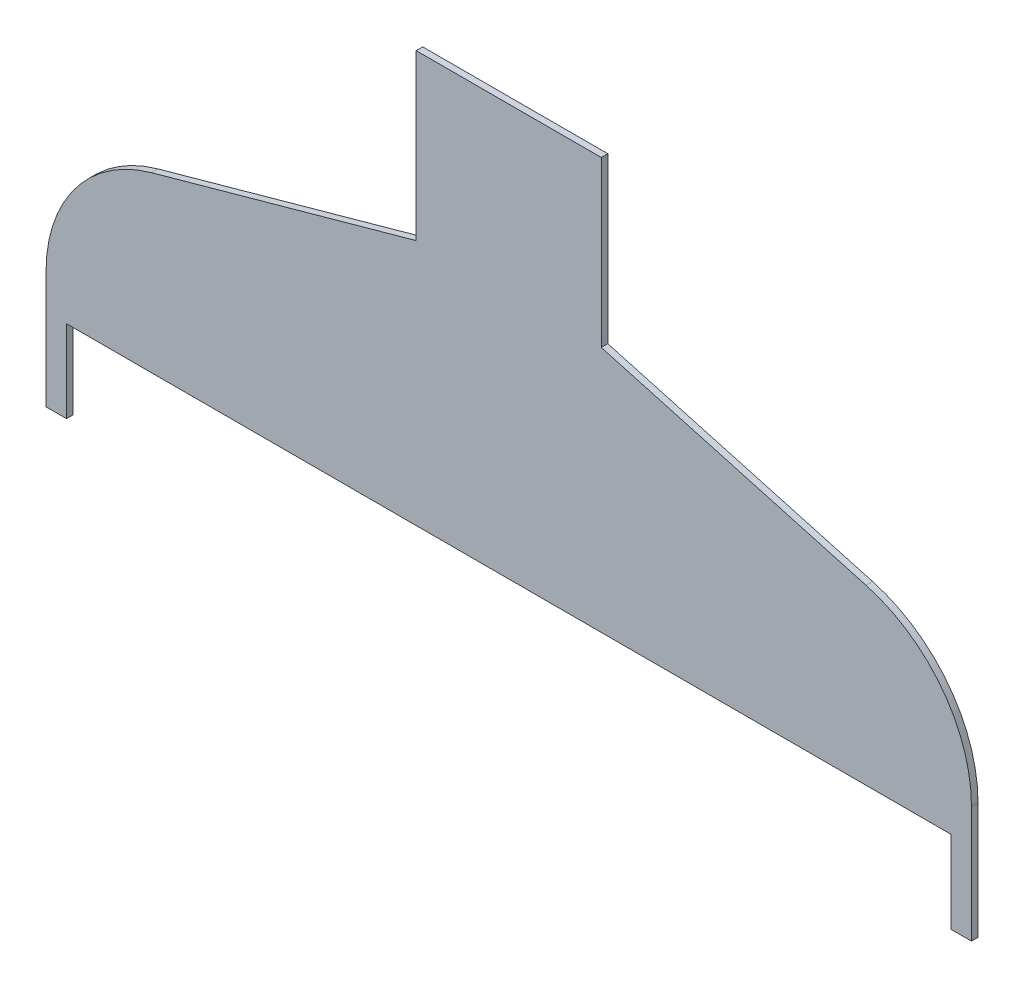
ISO-10303-21;
HEADER;
FILE_DESCRIPTION(('STEP AP214'),'2;1');
FILE_NAME('part.step','',(''),(''),'','','');
FILE_SCHEMA(('AUTOMOTIVE_DESIGN { 1 0 10303 214 1 1 1 1 }'));
ENDSEC;
DATA;
#1=APPLICATION_CONTEXT('core data for automotive mechanical design processes');
#2=APPLICATION_PROTOCOL_DEFINITION('international standard','automotive_design',2000,#1);
#3=PRODUCT_CONTEXT('',#1,'mechanical');
#4=PRODUCT('Part','Part','',(#3));
#5=PRODUCT_RELATED_PRODUCT_CATEGORY('part','',(#4));
#6=PRODUCT_DEFINITION_FORMATION('','',#4);
#7=PRODUCT_DEFINITION_CONTEXT('part definition',#1,'design');
#8=PRODUCT_DEFINITION('design','',#6,#7);
#9=PRODUCT_DEFINITION_SHAPE('','',#8);
#10=(LENGTH_UNIT() NAMED_UNIT(*) SI_UNIT(.MILLI.,.METRE.));
#11=(NAMED_UNIT(*) PLANE_ANGLE_UNIT() SI_UNIT($,.RADIAN.));
#12=(NAMED_UNIT(*) SI_UNIT($,.STERADIAN.) SOLID_ANGLE_UNIT());
#13=UNCERTAINTY_MEASURE_WITH_UNIT(LENGTH_MEASURE(1.E-05),#10,'distance_accuracy_value','');
#14=(GEOMETRIC_REPRESENTATION_CONTEXT(3) GLOBAL_UNCERTAINTY_ASSIGNED_CONTEXT((#13)) GLOBAL_UNIT_ASSIGNED_CONTEXT((#10,
#11,#12)) REPRESENTATION_CONTEXT('',''));
#15=CARTESIAN_POINT('',(0.,0.,0.));
#16=DIRECTION('',(0.,0.,1.));
#17=DIRECTION('',(1.,0.,0.));
#18=AXIS2_PLACEMENT_3D('',#15,#16,#17);
#19=CARTESIAN_POINT('',(-180.,-33.205995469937,3.175));
#20=DIRECTION('',(1.,0.,0.));
#21=DIRECTION('',(0.,0.,-1.));
#22=AXIS2_PLACEMENT_3D('',#19,#20,#21);
#23=PLANE('',#22);
#24=DIRECTION('',(0.,-1.,0.));
#25=VECTOR('',#24,1.);
#26=CARTESIAN_POINT('',(-180.,-33.205995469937,0.));
#27=LINE('',#26,#25);
#28=CARTESIAN_POINT('',(-180.,-33.205995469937,0.));
#29=VERTEX_POINT('',#28);
#30=CARTESIAN_POINT('',(-180.,-90.,0.));
#31=VERTEX_POINT('',#30);
#32=EDGE_CURVE('E165',#29,#31,#27,.T.);
#33=ORIENTED_EDGE('',*,*,#32,.T.);
#34=DIRECTION('',(0.,0.,-1.));
#35=VECTOR('',#34,1.);
#36=CARTESIAN_POINT('',(-180.,-90.,3.175));
#37=LINE('',#36,#35);
#38=CARTESIAN_POINT('',(-180.,-90.,3.175));
#39=VERTEX_POINT('',#38);
#40=EDGE_CURVE('E11',#39,#31,#37,.T.);
#41=ORIENTED_EDGE('',*,*,#40,.F.);
#42=DIRECTION('',(0.,-1.,0.));
#43=VECTOR('',#42,1.);
#44=CARTESIAN_POINT('',(-180.,-33.205995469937,3.175));
#45=LINE('',#44,#43);
#46=CARTESIAN_POINT('',(-180.,-33.205995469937,3.175));
#47=VERTEX_POINT('',#46);
#48=EDGE_CURVE('E192',#47,#39,#45,.T.);
#49=ORIENTED_EDGE('',*,*,#48,.F.);
#50=DIRECTION('',(0.,0.,-1.));
#51=VECTOR('',#50,1.);
#52=CARTESIAN_POINT('',(-180.,-33.205995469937,3.175));
#53=LINE('',#52,#51);
#54=EDGE_CURVE('E161',#47,#29,#53,.T.);
#55=ORIENTED_EDGE('',*,*,#54,.T.);
#56=EDGE_LOOP('',(#33,#41,#49,#55));
#57=FACE_BOUND('',#56,.T.);
#58=ADVANCED_FACE('F33',(#57),#23,.F.);
#59=CARTESIAN_POINT('',(-170.,-90.,3.175));
#60=DIRECTION('',(0.,1.,0.));
#61=DIRECTION('',(0.,0.,1.));
#62=AXIS2_PLACEMENT_3D('',#59,#60,#61);
#63=PLANE('',#62);
#64=DIRECTION('',(1.,0.,0.));
#65=VECTOR('',#64,1.);
#66=CARTESIAN_POINT('',(-170.,-90.,0.));
#67=LINE('',#66,#65);
#68=CARTESIAN_POINT('',(-170.,-90.,0.));
#69=VERTEX_POINT('',#68);
#70=EDGE_CURVE('E168',#31,#69,#67,.T.);
#71=ORIENTED_EDGE('',*,*,#70,.T.);
#72=DIRECTION('',(0.,0.,-1.));
#73=VECTOR('',#72,1.);
#74=CARTESIAN_POINT('',(-170.,-90.,3.175));
#75=LINE('',#74,#73);
#76=CARTESIAN_POINT('',(-170.,-90.,3.175));
#77=VERTEX_POINT('',#76);
#78=EDGE_CURVE('E41',#77,#69,#75,.T.);
#79=ORIENTED_EDGE('',*,*,#78,.F.);
#80=DIRECTION('',(1.,0.,0.));
#81=VECTOR('',#80,1.);
#82=CARTESIAN_POINT('',(-170.,-90.,3.175));
#83=LINE('',#82,#81);
#84=EDGE_CURVE('E110',#39,#77,#83,.T.);
#85=ORIENTED_EDGE('',*,*,#84,.F.);
#86=ORIENTED_EDGE('',*,*,#40,.T.);
#87=EDGE_LOOP('',(#71,#79,#85,#86));
#88=FACE_BOUND('',#87,.T.);
#89=ADVANCED_FACE('F279',(#88),#63,.F.);
#90=CARTESIAN_POINT('',(-170.,-90.,3.175));
#91=DIRECTION('',(-1.,0.,0.));
#92=DIRECTION('',(0.,-1.,0.));
#93=AXIS2_PLACEMENT_3D('',#90,#91,#92);
#94=PLANE('',#93);
#95=DIRECTION('',(0.,1.,0.));
#96=VECTOR('',#95,1.);
#97=CARTESIAN_POINT('',(-170.,-90.,0.));
#98=LINE('',#97,#96);
#99=CARTESIAN_POINT('',(-170.,-50.,0.));
#100=VERTEX_POINT('',#99);
#101=EDGE_CURVE('E170',#69,#100,#98,.T.);
#102=ORIENTED_EDGE('',*,*,#101,.T.);
#103=DIRECTION('',(0.,0.,-1.));
#104=VECTOR('',#103,1.);
#105=CARTESIAN_POINT('',(-170.,-50.,3.175));
#106=LINE('',#105,#104);
#107=CARTESIAN_POINT('',(-170.,-50.,3.175));
#108=VERTEX_POINT('',#107);
#109=EDGE_CURVE('E217',#108,#100,#106,.T.);
#110=ORIENTED_EDGE('',*,*,#109,.F.);
#111=DIRECTION('',(0.,1.,0.));
#112=VECTOR('',#111,1.);
#113=CARTESIAN_POINT('',(-170.,-90.,3.175));
#114=LINE('',#113,#112);
#115=EDGE_CURVE('E225',#77,#108,#114,.T.);
#116=ORIENTED_EDGE('',*,*,#115,.F.);
#117=ORIENTED_EDGE('',*,*,#78,.T.);
#118=EDGE_LOOP('',(#102,#110,#116,#117));
#119=FACE_BOUND('',#118,.T.);
#120=ADVANCED_FACE('F223',(#119),#94,.F.);
#121=CARTESIAN_POINT('',(260.,-50.,3.175));
#122=DIRECTION('',(0.,1.,0.));
#123=DIRECTION('',(0.,0.,1.));
#124=AXIS2_PLACEMENT_3D('',#121,#122,#123);
#125=PLANE('',#124);
#126=DIRECTION('',(1.,0.,0.));
#127=VECTOR('',#126,1.);
#128=CARTESIAN_POINT('',(260.,-50.,0.));
#129=LINE('',#128,#127);
#130=CARTESIAN_POINT('',(260.,-50.,0.));
#131=VERTEX_POINT('',#130);
#132=EDGE_CURVE('E173',#100,#131,#129,.T.);
#133=ORIENTED_EDGE('',*,*,#132,.T.);
#134=DIRECTION('',(0.,0.,-1.));
#135=VECTOR('',#134,1.);
#136=CARTESIAN_POINT('',(260.,-50.,3.175));
#137=LINE('',#136,#135);
#138=CARTESIAN_POINT('',(260.,-50.,3.175));
#139=VERTEX_POINT('',#138);
#140=EDGE_CURVE('E214',#139,#131,#137,.T.);
#141=ORIENTED_EDGE('',*,*,#140,.F.);
#142=DIRECTION('',(1.,0.,0.));
#143=VECTOR('',#142,1.);
#144=CARTESIAN_POINT('',(-170.,-50.,3.175));
#145=LINE('',#144,#143);
#146=EDGE_CURVE('E242',#108,#139,#145,.T.);
#147=ORIENTED_EDGE('',*,*,#146,.F.);
#148=ORIENTED_EDGE('',*,*,#109,.T.);
#149=EDGE_LOOP('',(#133,#141,#147,#148));
#150=FACE_BOUND('',#149,.T.);
#151=ADVANCED_FACE('F233',(#150),#125,.F.);
#152=CARTESIAN_POINT('',(260.,-90.,3.175));
#153=DIRECTION('',(1.,0.,0.));
#154=DIRECTION('',(0.,0.,-1.));
#155=AXIS2_PLACEMENT_3D('',#152,#153,#154);
#156=PLANE('',#155);
#157=DIRECTION('',(0.,-1.,0.));
#158=VECTOR('',#157,1.);
#159=CARTESIAN_POINT('',(260.,-90.,0.));
#160=LINE('',#159,#158);
#161=CARTESIAN_POINT('',(260.,-90.,0.));
#162=VERTEX_POINT('',#161);
#163=EDGE_CURVE('E175',#131,#162,#160,.T.);
#164=ORIENTED_EDGE('',*,*,#163,.T.);
#165=DIRECTION('',(0.,0.,-1.));
#166=VECTOR('',#165,1.);
#167=CARTESIAN_POINT('',(260.,-90.,3.175));
#168=LINE('',#167,#166);
#169=CARTESIAN_POINT('',(260.,-90.,3.175));
#170=VERTEX_POINT('',#169);
#171=EDGE_CURVE('E211',#170,#162,#168,.T.);
#172=ORIENTED_EDGE('',*,*,#171,.F.);
#173=DIRECTION('',(0.,-1.,0.));
#174=VECTOR('',#173,1.);
#175=CARTESIAN_POINT('',(260.,-90.,3.175));
#176=LINE('',#175,#174);
#177=EDGE_CURVE('E239',#139,#170,#176,.T.);
#178=ORIENTED_EDGE('',*,*,#177,.F.);
#179=ORIENTED_EDGE('',*,*,#140,.T.);
#180=EDGE_LOOP('',(#164,#172,#178,#179));
#181=FACE_BOUND('',#180,.T.);
#182=ADVANCED_FACE('F237',(#181),#156,.F.);
#183=CARTESIAN_POINT('',(260.,-90.,3.175));
#184=DIRECTION('',(0.,1.,0.));
#185=DIRECTION('',(0.,0.,1.));
#186=AXIS2_PLACEMENT_3D('',#183,#184,#185);
#187=PLANE('',#186);
#188=DIRECTION('',(1.,0.,0.));
#189=VECTOR('',#188,1.);
#190=CARTESIAN_POINT('',(260.,-90.,0.));
#191=LINE('',#190,#189);
#192=CARTESIAN_POINT('',(270.,-90.,0.));
#193=VERTEX_POINT('',#192);
#194=EDGE_CURVE('E177',#162,#193,#191,.T.);
#195=ORIENTED_EDGE('',*,*,#194,.T.);
#196=DIRECTION('',(0.,0.,-1.));
#197=VECTOR('',#196,1.);
#198=CARTESIAN_POINT('',(270.,-90.,3.175));
#199=LINE('',#198,#197);
#200=CARTESIAN_POINT('',(270.,-90.,3.175));
#201=VERTEX_POINT('',#200);
#202=EDGE_CURVE('E208',#201,#193,#199,.T.);
#203=ORIENTED_EDGE('',*,*,#202,.F.);
#204=DIRECTION('',(1.,0.,0.));
#205=VECTOR('',#204,1.);
#206=CARTESIAN_POINT('',(260.,-90.,3.175));
#207=LINE('',#206,#205);
#208=EDGE_CURVE('E241',#170,#201,#207,.T.);
#209=ORIENTED_EDGE('',*,*,#208,.F.);
#210=ORIENTED_EDGE('',*,*,#171,.T.);
#211=EDGE_LOOP('',(#195,#203,#209,#210));
#212=FACE_BOUND('',#211,.T.);
#213=ADVANCED_FACE('F292',(#212),#187,.F.);
#214=CARTESIAN_POINT('',(270.,-33.205995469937,3.175));
#215=DIRECTION('',(-1.,0.,0.));
#216=DIRECTION('',(0.,0.,1.));
#217=AXIS2_PLACEMENT_3D('',#214,#215,#216);
#218=PLANE('',#217);
#219=DIRECTION('',(0.,1.,0.));
#220=VECTOR('',#219,1.);
#221=CARTESIAN_POINT('',(270.,-33.205995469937,0.));
#222=LINE('',#221,#220);
#223=CARTESIAN_POINT('',(270.,-33.205995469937,0.));
#224=VERTEX_POINT('',#223);
#225=EDGE_CURVE('E179',#193,#224,#222,.T.);
#226=ORIENTED_EDGE('',*,*,#225,.T.);
#227=DIRECTION('',(0.,0.,-1.));
#228=VECTOR('',#227,1.);
#229=CARTESIAN_POINT('',(270.,-33.205995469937,3.175));
#230=LINE('',#229,#228);
#231=CARTESIAN_POINT('',(270.,-33.205995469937,3.175));
#232=VERTEX_POINT('',#231);
#233=EDGE_CURVE('E205',#232,#224,#230,.T.);
#234=ORIENTED_EDGE('',*,*,#233,.F.);
#235=DIRECTION('',(0.,1.,0.));
#236=VECTOR('',#235,1.);
#237=CARTESIAN_POINT('',(270.,-33.205995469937,3.175));
#238=LINE('',#237,#236);
#239=EDGE_CURVE('E244',#201,#232,#238,.T.);
#240=ORIENTED_EDGE('',*,*,#239,.F.);
#241=ORIENTED_EDGE('',*,*,#202,.T.);
#242=EDGE_LOOP('',(#226,#234,#240,#241));
#243=FACE_BOUND('',#242,.T.);
#244=ADVANCED_FACE('F295',(#243),#218,.F.);
#245=CARTESIAN_POINT('',(200.,-33.2059954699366,3.175));
#246=DIRECTION('',(0.,0.,-1.));
#247=DIRECTION('',(-1.,0.,0.));
#248=AXIS2_PLACEMENT_3D('',#245,#246,#247);
#249=CYLINDRICAL_SURFACE('',#248,70.);
#250=CARTESIAN_POINT('',(200.,-33.2059954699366,0.));
#251=DIRECTION('',(0.,0.,1.));
#252=DIRECTION('',(-1.,0.,0.));
#253=AXIS2_PLACEMENT_3D('',#250,#251,#252);
#254=CIRCLE('',#253,70.);
#255=CARTESIAN_POINT('',(218.735070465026,34.2402582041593,0.));
#256=VERTEX_POINT('',#255);
#257=EDGE_CURVE('E181',#224,#256,#254,.T.);
#258=ORIENTED_EDGE('',*,*,#257,.T.);
#259=DIRECTION('',(0.,0.,-1.));
#260=VECTOR('',#259,1.);
#261=CARTESIAN_POINT('',(218.735070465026,34.2402582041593,3.175));
#262=LINE('',#261,#260);
#263=CARTESIAN_POINT('',(218.735070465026,34.2402582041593,3.175));
#264=VERTEX_POINT('',#263);
#265=EDGE_CURVE('E202',#264,#256,#262,.T.);
#266=ORIENTED_EDGE('',*,*,#265,.F.);
#267=CARTESIAN_POINT('',(200.,-33.2059954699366,3.175));
#268=DIRECTION('',(0.,0.,1.));
#269=DIRECTION('',(-1.,0.,0.));
#270=AXIS2_PLACEMENT_3D('',#267,#268,#269);
#271=CIRCLE('',#270,70.);
#272=EDGE_CURVE('E250',#232,#264,#271,.T.);
#273=ORIENTED_EDGE('',*,*,#272,.F.);
#274=ORIENTED_EDGE('',*,*,#233,.T.);
#275=EDGE_LOOP('',(#258,#266,#273,#274));
#276=FACE_BOUND('',#275,.T.);
#277=ADVANCED_FACE('F299',(#276),#249,.T.);
#278=CARTESIAN_POINT('',(89.9999999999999,70.,3.175));
#279=DIRECTION('',(-0.267643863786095,-0.963517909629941,0.));
#280=DIRECTION('',(0.963517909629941,-0.267643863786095,0.));
#281=AXIS2_PLACEMENT_3D('',#278,#279,#280);
#282=PLANE('',#281);
#283=DIRECTION('',(-0.963517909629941,0.267643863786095,0.));
#284=VECTOR('',#283,1.);
#285=CARTESIAN_POINT('',(89.9999999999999,70.,0.));
#286=LINE('',#285,#284);
#287=CARTESIAN_POINT('',(89.9999999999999,70.,0.));
#288=VERTEX_POINT('',#287);
#289=EDGE_CURVE('E183',#256,#288,#286,.T.);
#290=ORIENTED_EDGE('',*,*,#289,.T.);
#291=DIRECTION('',(0.,0.,-1.));
#292=VECTOR('',#291,1.);
#293=CARTESIAN_POINT('',(89.9999999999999,70.,3.175));
#294=LINE('',#293,#292);
#295=CARTESIAN_POINT('',(89.9999999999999,70.,3.175));
#296=VERTEX_POINT('',#295);
#297=EDGE_CURVE('E199',#296,#288,#294,.T.);
#298=ORIENTED_EDGE('',*,*,#297,.F.);
#299=DIRECTION('',(-0.963517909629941,0.267643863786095,0.));
#300=VECTOR('',#299,1.);
#301=CARTESIAN_POINT('',(89.9999999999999,70.,3.175));
#302=LINE('',#301,#300);
#303=EDGE_CURVE('E252',#264,#296,#302,.T.);
#304=ORIENTED_EDGE('',*,*,#303,.F.);
#305=ORIENTED_EDGE('',*,*,#265,.T.);
#306=EDGE_LOOP('',(#290,#298,#304,#305));
#307=FACE_BOUND('',#306,.T.);
#308=ADVANCED_FACE('F303',(#307),#282,.F.);
#309=CARTESIAN_POINT('',(89.9999999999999,150.,3.175));
#310=DIRECTION('',(-1.,0.,0.));
#311=DIRECTION('',(0.,0.,1.));
#312=AXIS2_PLACEMENT_3D('',#309,#310,#311);
#313=PLANE('',#312);
#314=DIRECTION('',(0.,1.,0.));
#315=VECTOR('',#314,1.);
#316=CARTESIAN_POINT('',(89.9999999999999,150.,0.));
#317=LINE('',#316,#315);
#318=CARTESIAN_POINT('',(89.9999999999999,150.,0.));
#319=VERTEX_POINT('',#318);
#320=EDGE_CURVE('E185',#288,#319,#317,.T.);
#321=ORIENTED_EDGE('',*,*,#320,.T.);
#322=DIRECTION('',(0.,0.,-1.));
#323=VECTOR('',#322,1.);
#324=CARTESIAN_POINT('',(89.9999999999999,150.,3.175));
#325=LINE('',#324,#323);
#326=CARTESIAN_POINT('',(89.9999999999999,150.,3.175));
#327=VERTEX_POINT('',#326);
#328=EDGE_CURVE('E196',#327,#319,#325,.T.);
#329=ORIENTED_EDGE('',*,*,#328,.F.);
#330=DIRECTION('',(0.,1.,0.));
#331=VECTOR('',#330,1.);
#332=CARTESIAN_POINT('',(89.9999999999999,150.,3.175));
#333=LINE('',#332,#331);
#334=EDGE_CURVE('E254',#296,#327,#333,.T.);
#335=ORIENTED_EDGE('',*,*,#334,.F.);
#336=ORIENTED_EDGE('',*,*,#297,.T.);
#337=EDGE_LOOP('',(#321,#329,#335,#336));
#338=FACE_BOUND('',#337,.T.);
#339=ADVANCED_FACE('F260',(#338),#313,.F.);
#340=CARTESIAN_POINT('',(0.,150.,3.175));
#341=DIRECTION('',(0.,-1.,0.));
#342=DIRECTION('',(0.,0.,-1.));
#343=AXIS2_PLACEMENT_3D('',#340,#341,#342);
#344=PLANE('',#343);
#345=DIRECTION('',(-1.,0.,0.));
#346=VECTOR('',#345,1.);
#347=CARTESIAN_POINT('',(0.,150.,0.));
#348=LINE('',#347,#346);
#349=CARTESIAN_POINT('',(0.,150.,0.));
#350=VERTEX_POINT('',#349);
#351=EDGE_CURVE('E187',#319,#350,#348,.T.);
#352=ORIENTED_EDGE('',*,*,#351,.T.);
#353=DIRECTION('',(0.,0.,-1.));
#354=VECTOR('',#353,1.);
#355=CARTESIAN_POINT('',(0.,150.,3.175));
#356=LINE('',#355,#354);
#357=CARTESIAN_POINT('',(0.,150.,3.175));
#358=VERTEX_POINT('',#357);
#359=EDGE_CURVE('E156',#358,#350,#356,.T.);
#360=ORIENTED_EDGE('',*,*,#359,.F.);
#361=DIRECTION('',(-1.,0.,0.));
#362=VECTOR('',#361,1.);
#363=CARTESIAN_POINT('',(0.,150.,3.175));
#364=LINE('',#363,#362);
#365=EDGE_CURVE('E147',#327,#358,#364,.T.);
#366=ORIENTED_EDGE('',*,*,#365,.F.);
#367=ORIENTED_EDGE('',*,*,#328,.T.);
#368=EDGE_LOOP('',(#352,#360,#366,#367));
#369=FACE_BOUND('',#368,.T.);
#370=ADVANCED_FACE('F264',(#369),#344,.F.);
#371=CARTESIAN_POINT('',(0.,70.,3.175));
#372=DIRECTION('',(1.,0.,0.));
#373=DIRECTION('',(0.,1.,0.));
#374=AXIS2_PLACEMENT_3D('',#371,#372,#373);
#375=PLANE('',#374);
#376=DIRECTION('',(0.,-1.,0.));
#377=VECTOR('',#376,1.);
#378=CARTESIAN_POINT('',(0.,70.,0.));
#379=LINE('',#378,#377);
#380=CARTESIAN_POINT('',(0.,70.,0.));
#381=VERTEX_POINT('',#380);
#382=EDGE_CURVE('E155',#350,#381,#379,.T.);
#383=ORIENTED_EDGE('',*,*,#382,.T.);
#384=DIRECTION('',(0.,0.,-1.));
#385=VECTOR('',#384,1.);
#386=CARTESIAN_POINT('',(0.,70.,3.175));
#387=LINE('',#386,#385);
#388=CARTESIAN_POINT('',(0.,70.,3.175));
#389=VERTEX_POINT('',#388);
#390=EDGE_CURVE('E152',#389,#381,#387,.T.);
#391=ORIENTED_EDGE('',*,*,#390,.F.);
#392=DIRECTION('',(0.,-1.,0.));
#393=VECTOR('',#392,1.);
#394=CARTESIAN_POINT('',(0.,70.,3.175));
#395=LINE('',#394,#393);
#396=EDGE_CURVE('E141',#358,#389,#395,.T.);
#397=ORIENTED_EDGE('',*,*,#396,.F.);
#398=ORIENTED_EDGE('',*,*,#359,.T.);
#399=EDGE_LOOP('',(#383,#391,#397,#398));
#400=FACE_BOUND('',#399,.T.);
#401=ADVANCED_FACE('F153',(#400),#375,.F.);
#402=CARTESIAN_POINT('',(0.,70.,3.175));
#403=DIRECTION('',(0.267643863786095,-0.963517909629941,0.));
#404=DIRECTION('',(0.963517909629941,0.267643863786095,0.));
#405=AXIS2_PLACEMENT_3D('',#402,#403,#404);
#406=PLANE('',#405);
#407=DIRECTION('',(-0.963517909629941,-0.267643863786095,0.));
#408=VECTOR('',#407,1.);
#409=CARTESIAN_POINT('',(0.,70.,0.));
#410=LINE('',#409,#408);
#411=CARTESIAN_POINT('',(-128.735070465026,34.2402582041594,0.));
#412=VERTEX_POINT('',#411);
#413=EDGE_CURVE('E96',#381,#412,#410,.T.);
#414=ORIENTED_EDGE('',*,*,#413,.T.);
#415=DIRECTION('',(0.,0.,-1.));
#416=VECTOR('',#415,1.);
#417=CARTESIAN_POINT('',(-128.735070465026,34.2402582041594,3.175));
#418=LINE('',#417,#416);
#419=CARTESIAN_POINT('',(-128.735070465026,34.2402582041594,3.175));
#420=VERTEX_POINT('',#419);
#421=EDGE_CURVE('E157',#420,#412,#418,.T.);
#422=ORIENTED_EDGE('',*,*,#421,.F.);
#423=DIRECTION('',(-0.963517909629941,-0.267643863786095,0.));
#424=VECTOR('',#423,1.);
#425=CARTESIAN_POINT('',(0.,70.,3.175));
#426=LINE('',#425,#424);
#427=EDGE_CURVE('E145',#389,#420,#426,.T.);
#428=ORIENTED_EDGE('',*,*,#427,.F.);
#429=ORIENTED_EDGE('',*,*,#390,.T.);
#430=EDGE_LOOP('',(#414,#422,#428,#429));
#431=FACE_BOUND('',#430,.T.);
#432=ADVANCED_FACE('F159',(#431),#406,.F.);
#433=CARTESIAN_POINT('',(-110.,-33.2059954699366,3.175));
#434=DIRECTION('',(0.,0.,-1.));
#435=DIRECTION('',(-1.,0.,0.));
#436=AXIS2_PLACEMENT_3D('',#433,#434,#435);
#437=CYLINDRICAL_SURFACE('',#436,70.);
#438=CARTESIAN_POINT('',(-110.,-33.2059954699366,0.));
#439=DIRECTION('',(0.,0.,1.));
#440=DIRECTION('',(1.,0.,0.));
#441=AXIS2_PLACEMENT_3D('',#438,#439,#440);
#442=CIRCLE('',#441,70.);
#443=EDGE_CURVE('E102',#412,#29,#442,.T.);
#444=ORIENTED_EDGE('',*,*,#443,.T.);
#445=ORIENTED_EDGE('',*,*,#54,.F.);
#446=CARTESIAN_POINT('',(-110.,-33.2059954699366,3.175));
#447=DIRECTION('',(0.,0.,1.));
#448=DIRECTION('',(1.,0.,0.));
#449=AXIS2_PLACEMENT_3D('',#446,#447,#448);
#450=CIRCLE('',#449,70.);
#451=EDGE_CURVE('E49',#420,#47,#450,.T.);
#452=ORIENTED_EDGE('',*,*,#451,.F.);
#453=ORIENTED_EDGE('',*,*,#421,.T.);
#454=EDGE_LOOP('',(#444,#445,#452,#453));
#455=FACE_BOUND('',#454,.T.);
#456=ADVANCED_FACE('F268',(#455),#437,.T.);
#457=CARTESIAN_POINT('',(200.,-33.2059954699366,3.175));
#458=DIRECTION('',(0.,0.,-1.));
#459=DIRECTION('',(-1.,0.,0.));
#460=AXIS2_PLACEMENT_3D('',#457,#458,#459);
#461=PLANE('',#460);
#462=ORIENTED_EDGE('',*,*,#48,.T.);
#463=ORIENTED_EDGE('',*,*,#84,.T.);
#464=ORIENTED_EDGE('',*,*,#115,.T.);
#465=ORIENTED_EDGE('',*,*,#146,.T.);
#466=ORIENTED_EDGE('',*,*,#177,.T.);
#467=ORIENTED_EDGE('',*,*,#208,.T.);
#468=ORIENTED_EDGE('',*,*,#239,.T.);
#469=ORIENTED_EDGE('',*,*,#272,.T.);
#470=ORIENTED_EDGE('',*,*,#303,.T.);
#471=ORIENTED_EDGE('',*,*,#334,.T.);
#472=ORIENTED_EDGE('',*,*,#365,.T.);
#473=ORIENTED_EDGE('',*,*,#396,.T.);
#474=ORIENTED_EDGE('',*,*,#427,.T.);
#475=ORIENTED_EDGE('',*,*,#451,.T.);
#476=EDGE_LOOP('',(#462,#463,#464,#465,#466,#467,#468,#469,#470,#471,#472,#473,#474,#475));
#477=FACE_BOUND('',#476,.T.);
#478=ADVANCED_FACE('F143',(#477),#461,.F.);
#479=CARTESIAN_POINT('',(200.,-33.2059954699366,0.));
#480=DIRECTION('',(0.,0.,-1.));
#481=DIRECTION('',(-1.,0.,0.));
#482=AXIS2_PLACEMENT_3D('',#479,#480,#481);
#483=PLANE('',#482);
#484=ORIENTED_EDGE('',*,*,#32,.F.);
#485=ORIENTED_EDGE('',*,*,#443,.F.);
#486=ORIENTED_EDGE('',*,*,#413,.F.);
#487=ORIENTED_EDGE('',*,*,#382,.F.);
#488=ORIENTED_EDGE('',*,*,#351,.F.);
#489=ORIENTED_EDGE('',*,*,#320,.F.);
#490=ORIENTED_EDGE('',*,*,#289,.F.);
#491=ORIENTED_EDGE('',*,*,#257,.F.);
#492=ORIENTED_EDGE('',*,*,#225,.F.);
#493=ORIENTED_EDGE('',*,*,#194,.F.);
#494=ORIENTED_EDGE('',*,*,#163,.F.);
#495=ORIENTED_EDGE('',*,*,#132,.F.);
#496=ORIENTED_EDGE('',*,*,#101,.F.);
#497=ORIENTED_EDGE('',*,*,#70,.F.);
#498=EDGE_LOOP('',(#484,#485,#486,#487,#488,#489,#490,#491,#492,#493,#494,#495,#496,#497));
#499=FACE_BOUND('',#498,.T.);
#500=ADVANCED_FACE('F228',(#499),#483,.T.);
#501=CLOSED_SHELL('',(#58,#89,#120,#151,#182,#213,#244,#277,#308,#339,#370,#401,#432,#456,#478,#500));
#502=MANIFOLD_SOLID_BREP('B2',#501);
#503=ADVANCED_BREP_SHAPE_REPRESENTATION('',(#18,#502),#14);
#504=SHAPE_DEFINITION_REPRESENTATION(#9,#503);
ENDSEC;
END-ISO-10303-21;
